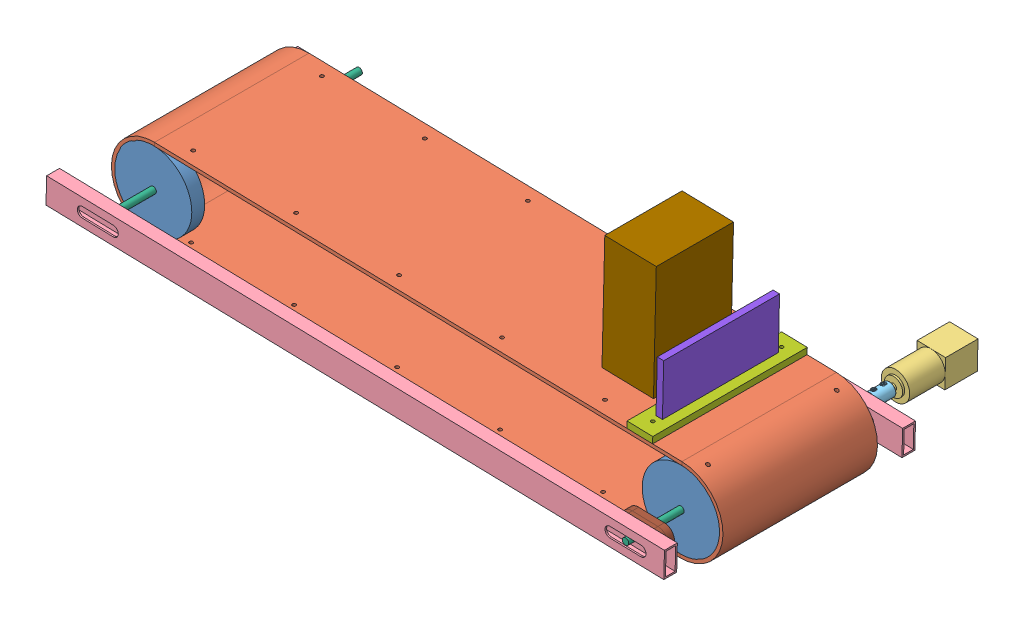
SolidWorks assembly Assem1.SLDASM, configuration Default (file format 15000). Lengths in mm.
Overall size (626.99 211.67 343.35).
31 component instances, 11 part files, 73 mates.
Components (placement in the parent):
- Flat Belt Pulley Large Dia-1: Flat Belt Pulley Large Dia.SLDPRT [Default] at (25.7502 53.0968 79.0735) size (76.2 76.2 12.7)
- Flat Belt Pulley Large Dia-3: Flat Belt Pulley Large Dia.SLDPRT [Default] at (25.7502 53.0968 218.7735) x (0.820102 -0.572217 0) z (0 0 1) size (76.2 76.2 12.7)
- Flat belt-1: Flat belt.SLDPRT [Default] at (-494.4676 65.7244 155.2735) x (0.999706 -0.024266 0) z (0 0 1) size (603.43 83.06 152.4)
- Flat Belt Pulley Large Dia-7: Flat Belt Pulley Large Dia.SLDPRT [Default] at (-494.4676 65.7244 79.0735) x (0.651159 0.758941 0) z (0 0 1) size (76.2 76.2 12.7)
- Flat Belt Pulley Large Dia-8: Flat Belt Pulley Large Dia.SLDPRT [Default] at (-494.7964 65.8619 218.7735) x (-0.263933 0.964541 0) z (0 0 1) size (76.2 76.2 12.7)
- Nema 11 14to1-1: Nema 11 14to1.SLDPRT [Default] at (25.7502 53.0968 -47.2665) x (0.999685 -0.025095 0) z (0 0 1) size (28 28 95)
- aluminum tube-1: aluminum tube.SLDPRT [Default] at (76.5236 51.5202 57.4835) x (0 0 1) z (-0.999685 0.025095 0) size (12.7 25.4 609.6)
- 6412K11_Set Screw Shaft Coupling-1: 6412K11_Set Screw Shaft Coupling.SLDPRT [6412K11] at (25.7502 53.0968 35.2585) x (0.973295 0.229559 0) z (0 0 1) size (12.7 13.7 19.05)
- Shaft-1: Shaft.SLDPRT [Default] at (25.7502 53.0968 286.0835) x (0.720178 0.693789 0) z (-0.693789 0.720178 0) size (6.35 247.65 6.35)
- Shaft-2: Shaft.SLDPRT [Default] at (-494.7964 65.8619 28.2735) x (0.700911 -0.713249 0) z (-0.713249 -0.700911 0) size (6.35 247.65 6.35)
- Cross Link-1: Cross Link.SLDPRT [Default] at (-14.6671 101.971 155.2735) x (0 0 -1) z (-0.999706 0.024266 0) size (152.4 6.35 25.4) (hidden)
- Cross Link-2: Cross Link.SLDPRT [Default] at (-116.2372 104.4365 155.2735) x (0 0 -1) z (-0.999706 0.024266 0) size (152.4 6.35 25.4) (hidden)
- Cross Link-3: Cross Link.SLDPRT [Default] at (-217.8073 106.902 155.2735) x (0 0 -1) z (-0.999706 0.024266 0) size (152.4 6.35 25.4) (hidden)
- Cross Link-4: Cross Link.SLDPRT [Default] at (-319.3774 109.3674 155.2735) x (0 0 -1) z (-0.999706 0.024266 0) size (152.4 6.35 25.4) (hidden)
- Cross Link-5: Cross Link.SLDPRT [Default] at (-420.9475 111.8329 155.2735) x (0 0 -1) z (-0.999706 0.024266 0) size (152.4 6.35 25.4) (hidden)
- Vertical Supports-1: Vertical Supports.SLDPRT [Default] at (-17.2248 127.4406 155.2735) x (0 0 -1) z (0.999706 -0.024266 0) size (114.3 57.15 6.35) (hidden)
- Vertical Supports-2: Vertical Supports.SLDPRT [Default] at (-118.7949 129.906 155.2735) x (0 0 -1) z (0.999706 -0.024266 0) size (114.3 57.15 6.35) (hidden)
- Vertical Supports-3: Vertical Supports.SLDPRT [Default] at (-220.365 132.3715 155.2735) x (0 0 -1) z (0.999706 -0.024266 0) size (114.3 57.15 6.35) (hidden)
- Vertical Supports-4: Vertical Supports.SLDPRT [Default] at (-321.9351 134.837 155.2735) x (0 0 -1) z (0.999706 -0.024266 0) size (114.3 57.15 6.35) (hidden)
- Vertical Supports-5: Vertical Supports.SLDPRT [Default] at (-423.5052 137.3025 155.2735) x (0 0 -1) z (0.999706 -0.024266 0) size (114.3 57.15 6.35) (hidden)
- Vertical Supports-6: Vertical Supports.SLDPRT [Default] at (-525.0752 139.7679 155.2735) x (0 0 -1) z (0.999706 -0.024266 0) size (114.3 57.15 6.35) (hidden)
- Toy-1: Toy.SLDPRT [Default] at (-88.78 154.585 155.2735) x (0 0 -1) z (0.999706 -0.024266 0) size (76.2 114.3 50.8)
- Bearing subassembly-1: Bearing subassembly.SLDASM [Default] at (35.3022 58.0575 58.5018) x (-0.905598 0.424138 0) z (0 0 1) size (50.02 36.28 12.7)
  - 60355K503_Ball Bearing-1: 60355K503_Ball Bearing.SLDPRT [60355K503] at (6.5463 8.5438 11.6817) size (15.88 15.88 4.98)
  - bearing housing-1: bearing housing.SLDPRT [Default] at (6.5463 8.5438 18.0317) x (-0.923728 -0.383049 0) z (0 0 -1) size (45.72 20.32 6.35)
  - bearing housing-2: bearing housing.SLDPRT [Default] at (6.5463 8.5438 5.3317) x (0.923728 0.383049 0) z (0 0 1) size (45.72 20.32 6.35)
- aluminum tube-3: aluminum tube.SLDPRT [Default] at (-545.5712 67.3859 279.7335) x (0 0 -1) z (0.999687 -0.025003 0) size (12.7 25.4 609.6)
- Bearing subassembly-2: Bearing subassembly.SLDASM [Default] at (16.2987 47.9469 255.3518) x (0.913862 -0.406025 0) z (0 0 1) size (50.02 36.28 12.7)
  - 60355K503_Ball Bearing-1: 60355K503_Ball Bearing.SLDPRT [60355K503] at (6.5463 8.5438 11.6817) size (15.88 15.88 4.98)
  - bearing housing-1: bearing housing.SLDPRT [Default] at (6.5463 8.5438 18.0317) x (-0.923728 -0.383049 0) z (0 0 -1) size (45.72 20.32 6.35)
  - bearing housing-2: bearing housing.SLDPRT [Default] at (6.5463 8.5438 5.3317) x (0.923728 0.383049 0) z (0 0 1) size (45.72 20.32 6.35)
Mates (geometry in assembly coordinates):
- Coincident1: coincident anti-aligned: plane of Flat Belt Pulley Large Dia-1 through (25.7502 53.0968 91.7735) normal (0 0 1); plane of Flat Belt Pulley Small Dia-1 through (25.7502 53.0968 91.7735) normal (0 0 -1)
- Concentric1: concentric aligned: circle of Flat Belt Pulley Large Dia-1; circle of Flat Belt Pulley Small Dia-1
- Coincident2: coincident aligned: plane of Flat Belt Pulley Small Dia-1 through (25.7502 53.0968 98.1235) normal (0 0 1); circle of Flat Belt Pulley Large Dia-2
- Concentric2: concentric aligned: circle of Flat Belt Pulley Small Dia-1; circle of Flat Belt Pulley Large Dia-2
- Concentric3: concentric aligned: circle of Flat Belt Pulley Large Dia-3; circle of Flat Belt Pulley Small Dia-2
- Concentric4: concentric aligned: circle of Flat Belt Pulley Large Dia-4; circle of Flat Belt Pulley Small Dia-2
- Coincident3: coincident aligned: circle of Flat Belt Pulley Large Dia-3; plane of Flat Belt Pulley Small Dia-2 through (25.7502 53.0968 218.7735) normal (0 0 1)
- Coincident4: coincident anti-aligned: plane of Flat Belt Pulley Large Dia-4 through (25.7502 53.0968 212.4235) normal (0 0 1); plane of Flat Belt Pulley Small Dia-2 through (25.7502 53.0968 212.4235) normal (0 0 -1)
- Concentric5: concentric aligned: circle of Flat Belt Pulley Large Dia-2; circle of Flat Belt Pulley Large Dia-4
- Coincident6: coincident aligned: plane of Flat Belt Pulley Large Dia-3 through (25.7502 53.0968 231.4735) normal (0 0 1); plane of Flat belt-1 through (-495.3921 27.6356 231.4735) normal (0 0 1)
- Concentric6: concentric aligned: circle of Flat Belt Pulley Large Dia-3; circle of Flat belt-1
- Coincident7: coincident aligned: plane of Flat Belt Pulley Large Dia-1 through (25.7502 53.0968 79.0735) normal (0 0 -1); plane of Flat belt-1 through (24.8256 15.008 79.0735) normal (0 0 -1)
- Concentric7: concentric aligned: circle of Flat Belt Pulley Large Dia-1; circle of Flat belt-1
- Concentric8: concentric aligned: circle of Flat Belt Pulley Large Dia-5; circle of Flat Belt Pulley Small Dia-4
- Concentric9: concentric aligned: circle of Flat Belt Pulley Large Dia-5; circle of Flat Belt Pulley Large Dia-6
- Concentric10: concentric aligned: circle of Flat Belt Pulley Small Dia-3; circle of Flat Belt Pulley Large Dia-7
- Concentric12: concentric aligned: circle of Flat Belt Pulley Small Dia-3; circle of Flat Belt Pulley Large Dia-6
- Coincident8: coincident aligned: plane of Flat Belt Pulley Small Dia-3 through (-505.2482 -19.9561 225.1235) normal (0 0 1); circle of Flat Belt Pulley Large Dia-7
- Coincident9: coincident anti-aligned: plane of Flat Belt Pulley Small Dia-3 through (-505.2482 -19.9561 218.7735) normal (0 0 -1); plane of Flat Belt Pulley Large Dia-6 through (-505.2482 -19.9561 218.7735) normal (0 0 1)
- Coincident10: coincident aligned: circle of Flat Belt Pulley Large Dia-5; plane of Flat Belt Pulley Small Dia-4 through (-505.2482 -19.9561 91.7735) normal (0 0 1)
- Concentric13: concentric aligned: cylinder of Flat Belt Pulley Large Dia-1 through (25.7502 53.0968 91.7735) axis (0 0 -1) radius 3; cylinder of Nema 11 14to1-1 through (25.7502 53.0968 37.7335) axis (0 0 -1) radius 3
- Concentric14: concentric: cylinder of Nema 11 14to1-1 through (25.7502 53.0968 37.7335) axis (0 0 -1) radius 3; cylinder of 47065T412_T-Slotted Framing-1 through (25.7502 53.0968 38.3863) axis (0 0 -1) radius 3
- Width1: width anti-aligned: plane of Flat belt-1 through (26.7579 94.6136 231.4735) normal (0.024266 0.999706 0); plane of Flat belt-1 through (-495.4754 24.2076 231.4735) normal (-0.024266 -0.999706 0); plane of 47065T412_T-Slotted Framing-1 through (59.6895 77.4233 62.1831) normal (0.802172 -0.597094 0); plane of 47065T412_T-Slotted Framing-1 through (39.3144 92.5895 62.1831) normal (-0.802172 0.597094 0)
- Distance1: distance = 25.779 mm aligned: plane of 47065T412_T-Slotted Framing-1 through (58.9362 77.9841 62.1831) normal (0.597094 0.802172 0); plane of Nema 11 14to1-1 through (39.3944 38.7499 -15.2665) normal (0.999685 -0.025095 0)
- Coincident16: coincident anti-aligned: plane of Nema 11 14to1-1 through (25.7502 53.0968 19.7335) normal (0 0 1); plane of 47065T412_T-Slotted Framing-1 through (52.8633 82.5044 53.6735) normal (0 0 -1)
- Width2: width aligned: plane of Flat belt-1 through (26.7579 94.6136 231.4735) normal (0.024266 0.999706 0); plane of Flat belt-1 through (-495.4754 24.2076 231.4735) normal (-0.024266 -0.999706 0); plane of 47065T412_T-Slotted Framing-2 through (39.3144 92.5895 248.3639) normal (-0.802172 0.597094 0); plane of 47065T412_T-Slotted Framing-2 through (59.6895 77.4233 248.3639) normal (0.802172 -0.597094 0)
- Coincident17: coincident aligned: plane of 47065T412_T-Slotted Framing-1 through (58.9362 77.9841 62.1831) normal (0.597094 0.802172 0); plane of 47065T412_T-Slotted Framing-2 through (58.9362 77.9841 239.9831) normal (0.597094 0.802172 0)
- Parallel1: parallel anti-aligned: plane of Flat Belt Pulley Large Dia-3 through (25.7502 53.0968 231.4735) normal (0 0 1); plane of 47065T412_T-Slotted Framing-2 through (52.8633 82.5044 231.4735) normal (0 0 -1)
- Coincident19: coincident anti-aligned: plane of Flat Belt Pulley Large Dia-1 through (25.7502 53.0968 79.0735) normal (0 0 -1); plane of 47065T412_T-Slotted Framing-1 through (52.8633 82.5044 79.0735) normal (0 0 1)
- Coincident20: coincident anti-aligned: plane of Flat Belt Pulley Large Dia-3 through (25.7502 53.0968 231.4735) normal (0 0 1); plane of 47065T412_T-Slotted Framing-2 through (52.8633 82.5044 231.4735) normal (0 0 -1)
- Concentric15: concentric aligned: circle of Flat belt-1; circle of Flat Belt Pulley Large Dia-7
- Distance2: distance = 15.24 mm anti-aligned: plane of aluminum tube-1 through (-533.2031 54.122 63.8335) normal (0 0 1); plane of Flat Belt Pulley Large Dia-1 through (25.7502 53.0968 79.0735) normal (0 0 -1)
- Distance3: distance = 1 mm anti-aligned: plane of Nema 11 14to1-1 through (23.565 55.1523 25.7335) normal (0.025095 0.999685 0); plane of aluminum tube-1 through (32.1705 55.9366 51.1335) normal (-0.025095 -0.999685 0)
- Concentric21: concentric aligned: cylinder of Nema 11 14to1-1 through (25.7502 53.0968 37.7335) axis (0 0 -1) radius 3; cylinder of 6412K11_Set Screw Shaft Coupling-1 through (25.7502 53.0968 44.7835) axis (0 0 -1) radius 3.175
- Coincident28: coincident anti-aligned: plane of Nema 11 14to1-1 through (25.7502 53.0968 25.7335) normal (0 0 1); plane of 6412K11_Set Screw Shaft Coupling-1 through (25.7502 53.0968 25.7335) normal (0 0 -1)
- Concentric22: concentric aligned: cylinder of Flat Belt Pulley Large Dia-1 through (25.7502 53.0968 91.7735) axis (0 0 -1) radius 3; cylinder of Bearing-1 through (25.7502 53.0968 69.3735) axis (0 0 -1) radius 3.175
- Coincident29: coincident anti-aligned: plane of aluminum tube-1 through (-533.2031 54.122 63.8335) normal (0 0 1); plane of Bearing-1 through (25.7502 53.0968 66.3735) normal (0 0 -1)
- Concentric23: concentric anti-aligned: circle of 6412K11_Set Screw Shaft Coupling-1; cylinder of Shaft-1 through (25.7502 53.0968 286.0835) axis (0 0 1) radius 3.175
- Distance4: distance = 6.35 mm anti-aligned: plane of Shaft-1 through (25.7502 53.0968 38.4335) normal (0 0 -1); plane of 6412K11_Set Screw Shaft Coupling-1 through (25.7502 53.0968 44.7835) normal (0 0 1)
- Concentric24: concentric aligned: circle of aluminum tube-1; circle of aluminum tube-2
- Concentric25: concentric aligned: cylinder of aluminum tube-1 through (19.3916 52.9543 51.1335) axis (0 0 1) radius 3.302; cylinder of aluminum tube-2 through (24.2172 46.9242 244.1735) axis (0 0 1) radius 3.302
- Coincident31: coincident anti-aligned: plane of aluminum tube-2 through (-122.0841 -485.9531 244.1735) normal (0 0 -1); plane of Bearing-2 through (25.7502 53.0968 250.5235) normal (0 0 1)
- Concentric27: concentric anti-aligned: cylinder of aluminum tube-1 through (-494.7964 65.8619 51.1335) axis (0 0 1) radius 3.25; cylinder of Shaft-2 through (-494.7964 65.8619 28.2735) axis (0 0 -1) radius 3.175
- Coincident32: coincident anti-aligned: plane of Flat belt-1 through (26.7579 94.6136 231.4735) normal (0.024266 0.999706 0); plane of Cross Link-1 through (-14.8212 95.6229 155.2735) normal (-0.024266 -0.999706 0)
- Coincident33: coincident aligned: plane of Flat belt-1 through (26.6747 91.1856 231.4735) normal (0 0 1); plane of Cross Link-1 through (-27.5175 95.9311 231.4735) normal (0 0 1)
- Coincident34: coincident anti-aligned: plane of Flat belt-1 through (-495.4754 24.2076 231.4735) normal (-0.024266 -0.999706 0); plane of Cross Link-12 through (28.975 11.6537 155.2735) normal (-0.034127 0.999418 0)
- Coincident35: coincident aligned: plane of Flat belt-1 through (-495.3921 27.6356 79.0735) normal (0 0 -1); plane of Cross Link-12 through (41.6676 12.0871 79.0735) normal (0 0 -1)
- Concentric29: concentric: cylinder of Flat belt-1 through (20.1653 19.4257 91.7735) axis (0.088003 0.99612 0) radius 1.75; cylinder of Cross Link-12 through (27.8127 19.028 91.7735) axis (0.136293 -0.990669 0) radius 1.75
- Coincident36: coincident anti-aligned: plane of Cross Link-1 through (-11.6472 95.5458 206.0735) normal (-0.999706 0.024266 0); plane of Vertical Supports-1 through (-10.8767 127.2865 155.2735) normal (0.999706 -0.024266 0)
- Coincident37: coincident anti-aligned: plane of Flat belt-1 through (26.7579 94.6136 231.4735) normal (0.024266 0.999706 0); plane of Vertical Supports-1 through (-11.6472 95.5458 206.0735) normal (-0.024266 -0.999706 0)
- Coincident38: coincident anti-aligned: plane of Cross Link-1 through (-17.9953 95.6999 206.0735) normal (0 0 -1); plane of Vertical Supports-1 through (-11.4931 101.894 206.0735) normal (0 0 1)
- Coincident39: coincident anti-aligned: plane of Flat belt-1 through (-495.4754 24.2076 231.4735) normal (-0.024266 -0.999706 0); plane of Vertical Supports-12 through (25.8519 11.5471 206.0735) normal (-0.034127 0.999418 0)
- Coincident40: coincident anti-aligned: plane of Cross Link-12 through (32.1482 11.7621 104.4735) normal (0 0 1); plane of Vertical Supports-12 through (26.0686 5.2008 104.4735) normal (0 0 -1)
- Coincident41: coincident: plane of Cross Link-12 through (30.9581 19.4608 206.0735) normal (-0.990669 -0.136293 0); plane of Vertical Supports-12 through (35.2854 -11.993 155.2735) normal (0.990669 0.136293 0)
- Coincident42: coincident anti-aligned: plane of Flat belt-1 through (26.7579 94.6136 231.4735) normal (0.024266 0.999706 0); plane of Toy-1 through (-39.3817 96.219 193.3735) normal (-0.024266 -0.999706 0)
- Width3: width anti-aligned: plane of Flat belt-1 through (26.6747 91.1856 79.0735) normal (0 0 -1); plane of Toy-1 through (26.6747 91.1856 231.4735) normal (0 0 1); plane of Flat belt-1 through (-39.3817 96.219 193.3735) normal (0 0 1); plane of Toy-1 through (-39.3817 96.219 117.1735) normal (0 0 -1)
- Concentric31: concentric anti-aligned: cylinder of Flat belt-1 through (-494.4676 65.7244 155.2735) axis (0 0 1) radius 38.1; cylinder of Flat Belt Pulley Large Dia-7 through (-494.4676 65.7244 91.7735) axis (0 0 -1) radius 38.1
- Coincident43: coincident aligned: plane of Flat belt-1 through (26.6747 91.1856 79.0735) normal (0 0 -1); plane of Flat Belt Pulley Large Dia-7 through (-494.4676 65.7244 79.0735) normal (0 0 -1)
- Coincident44: coincident aligned: plane of Flat belt-1 through (26.6747 91.1856 231.4735) normal (0 0 1); plane of Flat Belt Pulley Large Dia-8 through (-494.7964 65.8619 231.4735) normal (0 0 1)
- Concentric32: concentric: cylinder of Flat belt-1 through (21.869 -467.2597 155.2735) axis (0 0 1) radius 38.1; cylinder of Flat Belt Pulley Large Dia-8 through (21.8876 -467.5919 231.4735) axis (0 0 -1) radius 38.1
- Concentric33: concentric aligned: cylinder of Flat Belt Pulley Large Dia-8 through (-494.7964 65.8619 231.4735) axis (0 0 -1) radius 3; cylinder of Shaft-2 through (-494.7964 65.8619 28.2735) axis (0 0 -1) radius 3.175
- Coincident45: coincident aligned: plane of Shaft-1 through (28.0367 55.2996 286.0835) normal (0 0 1); plane of aluminum tube-2 through (-122.0841 -485.9531 269.5735) normal (0 0 1)
- Width4: width anti-aligned: plane of Shaft-2 through (-492.571 63.5974 28.2735) normal (0 0 -1); plane of aluminum tube-2 through (-494.7964 65.8619 275.9235) normal (0 0 1); plane of Shaft-2 through (-122.0841 -485.9531 269.5735) normal (0 0 1); plane of aluminum tube-1 through (-533.2031 54.122 51.1335) normal (0 0 -1)
- Distance5: distance = 6.35 mm anti-aligned: plane of 6412K11_Set Screw Shaft Coupling-1 through (25.7502 53.0968 44.7835) normal (0 0 1); plane of aluminum tube-1 through (-533.2031 54.122 51.1335) normal (0 0 -1)
- Concentric34: concentric aligned: cylinder of Shaft-1 through (25.7502 53.0968 286.0835) axis (0 0 1) radius 3.175; cylinder of Bearing subassembly-1/60355K503_Ball Bearing-1 through (25.7502 53.0968 72.6727) axis (0 0 1) radius 3.175
- Coincident47: coincident anti-aligned: plane of aluminum tube-1 through (-533.2031 54.122 63.8335) normal (0 0 1); plane of Bearing subassembly-1/bearing housing-2 through (38.4374 52.5266 63.8335) normal (0 0 -1)
- Concentric37: concentric anti-aligned: cylinder of aluminum tube-1 through (40.9748 52.4125 51.1335) axis (0 0 1) radius 2.75; cylinder of Bearing subassembly-1/bearing housing-1 through (40.9748 52.4125 76.5335) axis (0 0 -1) radius 2.75
- Coincident48: coincident aligned: plane of Shaft-1 through (28.0367 55.2996 286.0835) normal (0 0 1); plane of aluminum tube-3 through (63.5207 39.4482 286.0835) normal (0 0 1)
- Coincident49: coincident anti-aligned: plane of aluminum tube-3 through (63.5207 39.4482 273.3835) normal (0 0 -1); plane of Bearing subassembly-2/bearing housing-1 through (38.4462 52.7793 273.3835) normal (0 0 1)
- Concentric38: concentric aligned: cylinder of aluminum tube-3 through (40.9854 52.7158 286.0835) axis (0 0 -1) radius 2.75; cylinder of Bearing subassembly-2/bearing housing-1 through (40.9854 52.7158 273.3835) axis (0 0 -1) radius 2.75
- Concentric39: concentric aligned: cylinder of Shaft-1 through (25.7502 53.0968 286.0835) axis (0 0 1) radius 3.175; cylinder of Bearing subassembly-2/60355K503_Ball Bearing-1 through (25.7502 53.0968 269.5227) axis (0 0 1) radius 3.175
- Distance6: distance = 3.556 mm: plane of aluminum tube-3 through (-501.0525 69.5755 286.0835) normal (-0.025003 -0.999687 0); cylinder of Shaft-2 through (-494.7964 65.8619 28.2735) axis (0 0 -1) radius 3.175
- Concentric40: concentric anti-aligned: cylinder of aluminum tube-3 through (10.5149 53.4779 286.0835) axis (0 0 -1) radius 2.75; cylinder of Bearing subassembly-2/bearing housing-2 through (10.5149 53.4779 260.6835) axis (0 0 1) radius 2.75
